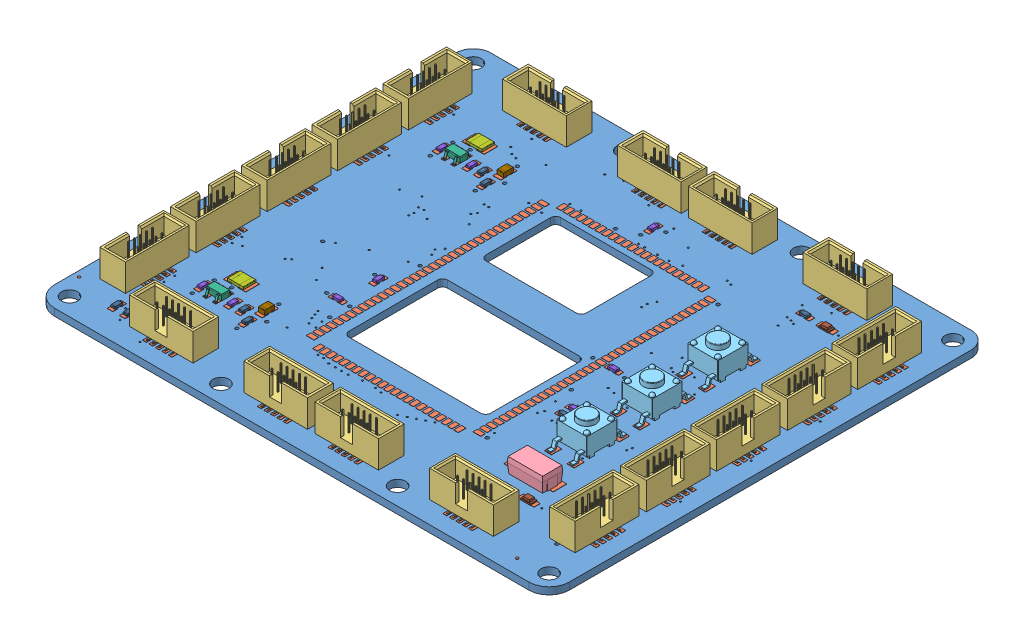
SolidWorks assembly FEZ_Raptor_Mainboard.SLDASM, configuration Default (file format 9000). Lengths in mm.
Overall size (102 7.2 87.04).
50 component instances, 11 part files, 0 mates.
Components (placement in the parent):
- FEZ_Raptor_Mainboard_PCB-1: FEZ_Raptor_Mainboard_PCB.sldprt [Default] at (-24.3 80.6234 -14.0862) x (1 0 0) z (0 1 0) size (102 87.04 1.4)
- FEZ_Raptor_Mainboard_Pads-1: FEZ_Raptor_Mainboard_Pads.sldprt [Default] at (-24.3229 81.9734 -14.0974) size (97.89 0.1 81.17)
- G_Socket-1: G_Socket.sldprt [Default] at (-3.0532 82.4234 -20.5308) size (12.62 5.8 6.04)
- G_Socket-2: G_Socket.sldprt [Default] at (19.6755 82.4234 -20.5079) size (12.62 5.8 6.04)
- G_Socket-3: G_Socket.sldprt [Default] at (33.7074 82.4234 -20.5232) size (12.62 5.8 6.04)
- G_Socket-4: G_Socket.sldprt [Default] at (56.4518 82.4234 -20.538) size (12.62 5.8 6.04)
- G_Socket-5: G_Socket.sldprt [Default] at (71.1207 82.4234 -29.5908) x (0 0 -1) z (1 0 0) size (12.62 5.8 6.04)
- G_Socket-6: G_Socket.sldprt [Default] at (71.159 82.4234 -43.6578) x (0 0 -1) z (1 0 0) size (12.62 5.8 6.04)
- G_Socket-7: G_Socket.sldprt [Default] at (71.1441 82.4234 -57.5807) x (0 0 -1) z (1 0 0) size (12.62 5.8 6.04)
- G_Socket-8: G_Socket.sldprt [Default] at (71.164 82.4234 -71.6172) x (0 0 -1) z (1 0 0) size (12.62 5.8 6.04)
- G_Socket-9: G_Socket.sldprt [Default] at (71.0954 82.4234 -85.5799) x (0 0 -1) z (1 0 0) size (12.62 5.8 6.04)
- G_Socket-10: G_Socket.sldprt [Default] at (56.3843 82.4234 -94.5634) x (-1 0 0) z (0 0 -1) size (12.62 5.8 6.04)
- G_Socket-11: G_Socket.sldprt [Default] at (33.6854 82.4234 -94.5366) x (-1 0 0) z (0 0 -1) size (12.62 5.8 6.04)
- G_Socket-12: G_Socket.sldprt [Default] at (19.633 82.4234 -94.5366) x (-1 0 0) z (0 0 -1) size (12.62 5.8 6.04)
- G_Socket-13: G_Socket.sldprt [Default] at (-3.0962 82.4234 -94.5182) x (-1 0 0) z (0 0 -1) size (12.62 5.8 6.04)
- G_Socket-14: G_Socket.sldprt [Default] at (-17.9118 82.4234 -85.6102) x (0 0 1) z (-1 0 0) size (12.62 5.8 6.04)
- G_Socket-15: G_Socket.sldprt [Default] at (-17.9243 82.4234 -71.5914) x (0 0 1) z (-1 0 0) size (12.62 5.8 6.04)
- G_Socket-16: G_Socket.sldprt [Default] at (-17.8987 82.4234 -57.6175) x (0 0 1) z (-1 0 0) size (12.62 5.8 6.04)
- G_Socket-17: G_Socket.sldprt [Default] at (-17.8794 82.4234 -43.5067) x (0 0 1) z (-1 0 0) size (12.62 5.8 6.04)
- G_Socket-18: G_Socket.sldprt [Default] at (-17.905 82.4234 -29.5459) x (0 0 1) z (-1 0 0) size (12.62 5.8 6.04)
- 7X4_Tantalum_Capacitor-1: 7X4_Tantalum_Capacitor.sldprt [Default] at (84.7618 82.0234 -11.8117) size (7.01 3 4)
- Reset-1: Reset.sldprt [Default] at (67.2795 82.1901 -53.7331) size (6 5.17 10.57)
- Reset-2: Reset.sldprt [Default] at (67.3246 82.1901 -40.6397) size (6 5.17 10.57)
- Reset-3: Reset.sldprt [Default] at (67.3246 82.1901 -27.7062) size (6 5.17 10.57)
- SOT23_5lead-1: SOT23_5lead.sldprt [Default] at (14.008 82.0992 -21.1893) size (3 1.28 3.19)
- SOT23_5lead-2: SOT23_5lead.sldprt [Default] at (14.0136 82.0992 -68.4366) size (3 1.28 3.19)
- R1210-1: R1210.sldprt [Default] at (-6.8556 81.9787 -83.7779) size (3.2 0.55 2.5)
- R1210-2: R1210.sldprt [Default] at (-6.8483 81.9965 -36.5197) size (3.2 0.55 2.5)
- C0603-1: C0603.sldprt [Default] at (-9.226 81.9477 -79.8141) x (0 0 1) z (-1 0 0) size (1.6 0.5 0.8)
- C0603-2: C0603.sldprt [Default] at (-3.3175 81.9655 -79.7736) x (0 0 1) z (-1 0 0) size (1.6 0.5 0.8)
- C0603-3: C0603.sldprt [Default] at (7.1041 82.013 -50.9039) x (0 0 1) z (-1 0 0) size (1.6 0.5 0.8)
- C0603-4: C0603.sldprt [Default] at (6.2868 81.9714 -43.6706) x (-1 0 0) z (0 0 -1) size (1.6 0.5 0.8)
- C0603-5: C0603.sldprt [Default] at (-3.3154 81.9536 -32.5081) x (0 0 1) z (-1 0 0) size (1.6 0.5 0.8)
- C0603-6: C0603.sldprt [Default] at (-9.2923 81.9477 -32.4939) x (0 0 1) z (-1 0 0) size (1.6 0.5 0.8)
- C0603-7: C0603.sldprt [Default] at (48.6913 81.9892 -48.1197) x (-1 0 0) z (0 0 -1) size (1.6 0.5 0.8)
- C0603-8: C0603.sldprt [Default] at (45.7055 81.9774 -58.8803) x (-1 0 0) z (0 0 -1) size (1.6 0.5 0.8)
- C0603-9: C0603.sldprt [Default] at (25.3862 81.9596 -87.0585) x (0 0 1) z (-1 0 0) size (1.6 0.5 0.8)
- C0805-1: C0805.sldprt [Default] at (1.2626 81.919 -81.8574) x (0 0 1) z (-1 0 0) size (2 1 1.25)
- C0805-2: C0805.sldprt [Default] at (1.2132 81.9427 -34.5888) x (0 0 1) z (-1 0 0) size (2 1 1.25)
- R0603-1: R0603.sldprt [Default] at (-1.1022 81.9655 -79.7701) x (0 0 1) z (-1 0 0) size (1.6 0.5 0.8)
- R0603-2: R0603.sldprt [Default] at (1.2102 82.013 -78.0437) x (0 0 1) z (-1 0 0) size (1.6 0.5 0.8)
- R0603-3: R0603.sldprt [Default] at (-1.1016 81.9536 -32.5134) x (0 0 1) z (-1 0 0) size (1.6 0.5 0.8)
- R0603-4: R0603.sldprt [Default] at (1.2261 81.9714 -30.8409) x (0 0 1) z (-1 0 0) size (1.6 0.5 0.8)
- R0603-5: R0603.sldprt [Default] at (-11.9938 81.9714 -20.5873) x (0 0 1) z (-1 0 0) size (1.6 0.5 0.8)
- R0603-6: R0603.sldprt [Default] at (-14.452 81.9774 -20.607) x (0 0 1) z (-1 0 0) size (1.6 0.5 0.8)
- R0603-7: R0603.sldprt [Default] at (55.3792 81.9952 -28.0409) x (-1 0 0) z (0 0 -1) size (1.6 0.5 0.8)
- R0603-8: R0603.sldprt [Default] at (48.6455 81.9774 -46.1301) x (-1 0 0) z (0 0 -1) size (1.6 0.5 0.8)
- R0603-9: R0603.sldprt [Default] at (55.3487 81.9774 -87.1445) x (-1 0 0) z (0 0 -1) size (1.6 0.5 0.8)
- Led-1: Led.sldprt [Default] at (69.2065 81.9701 -78.8608) size (2 0.7 1.3)
- Led-2: Led.sldprt [Default] at (69.2646 82.0175 -19.7994) size (2 0.7 1.3)
